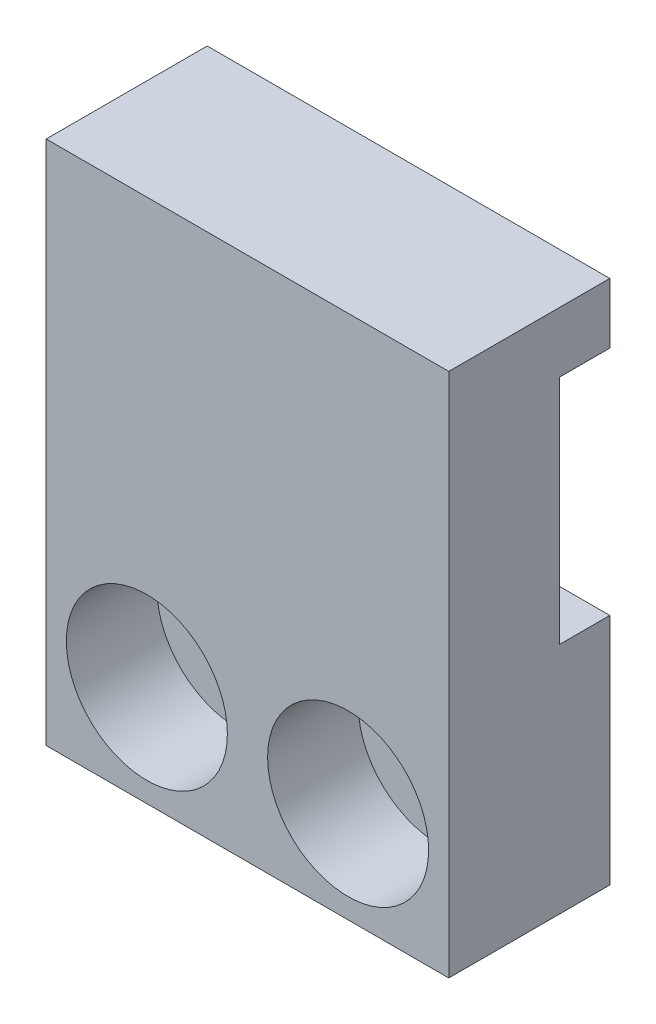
from build123d import *

# Parameters (mm, degrees)
SKETCH_1_W               = 20
SKETCH_1_H               = 26.1
SKETCH_1_R               = 2.25
EXTRUDE_1_DEPTH          = 8
SKETCH_2_R               = 4
CUT_EXTRUDE_1_DEPTH      = 4.5
CUT_EXTRUDE_2_DEPTH      = 34.840951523
CUT_EXTRUDE_2_DEPTH_BACK = 34.840951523


with BuildPart() as part:
    # Sketch 1 → Extrude 1 (new body)
    with BuildSketch(Plane.XY):
        with Locations((10, 13.05)):
            Rectangle(SKETCH_1_W, SKETCH_1_H)
        with Locations((5, 5)):
            Circle(SKETCH_1_R, mode=Mode.SUBTRACT)
        with Locations((15, 5)):
            Circle(SKETCH_1_R, mode=Mode.SUBTRACT)
    extrude(amount=EXTRUDE_1_DEPTH)

    # Sketch 2 → Cut-Extrude 1 (cut)
    with BuildSketch(Plane.XY.offset(8)):
        with Locations((5, 5)):
            Circle(SKETCH_2_R)
        with Locations((15, 5)):
            Circle(SKETCH_2_R)
    extrude(amount=-CUT_EXTRUDE_1_DEPTH, mode=Mode.SUBTRACT)

    # Sketch 3 → Cut-Extrude 2 (cut, two sides: drawn at the far end of the back side and taken through both)
    with BuildSketch(Plane(origin=(20, 0, 0), x_dir=(0, 0, -1), z_dir=(1, 0, 0)).offset(-CUT_EXTRUDE_2_DEPTH_BACK)):
        Polygon((58.892126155, 11.6), (0, 11.6), (-2.5, 11.6), (-2.5, 23.1), (0, 23.1), (58.892126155, 23.1), (176.676378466, 23.1), (176.676378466, 11.6), align=None)
    extrude(amount=CUT_EXTRUDE_2_DEPTH + CUT_EXTRUDE_2_DEPTH_BACK, mode=Mode.SUBTRACT)


solid = part.part
